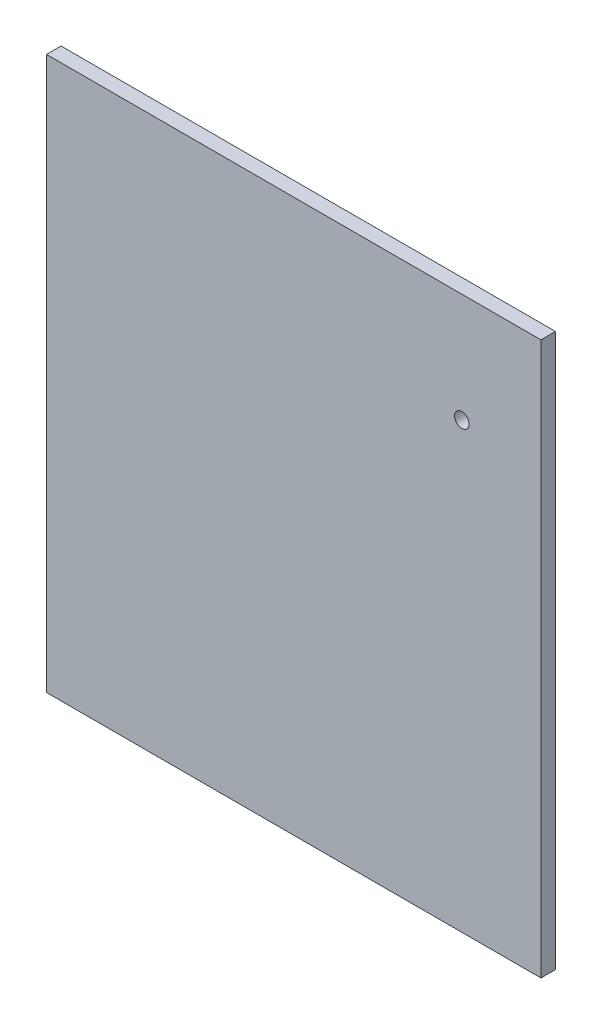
ISO-10303-21;
HEADER;
FILE_DESCRIPTION(('STEP AP214'),'2;1');
FILE_NAME('part.step','',(''),(''),'','','');
FILE_SCHEMA(('AUTOMOTIVE_DESIGN { 1 0 10303 214 1 1 1 1 }'));
ENDSEC;
DATA;
#1=APPLICATION_CONTEXT('core data for automotive mechanical design processes');
#2=APPLICATION_PROTOCOL_DEFINITION('international standard','automotive_design',2000,#1);
#3=PRODUCT_CONTEXT('',#1,'mechanical');
#4=PRODUCT('Part','Part','',(#3));
#5=PRODUCT_RELATED_PRODUCT_CATEGORY('part','',(#4));
#6=PRODUCT_DEFINITION_FORMATION('','',#4);
#7=PRODUCT_DEFINITION_CONTEXT('part definition',#1,'design');
#8=PRODUCT_DEFINITION('design','',#6,#7);
#9=PRODUCT_DEFINITION_SHAPE('','',#8);
#10=(LENGTH_UNIT() NAMED_UNIT(*) SI_UNIT(.MILLI.,.METRE.));
#11=(NAMED_UNIT(*) PLANE_ANGLE_UNIT() SI_UNIT($,.RADIAN.));
#12=(NAMED_UNIT(*) SI_UNIT($,.STERADIAN.) SOLID_ANGLE_UNIT());
#13=UNCERTAINTY_MEASURE_WITH_UNIT(LENGTH_MEASURE(1.E-05),#10,'distance_accuracy_value','');
#14=(GEOMETRIC_REPRESENTATION_CONTEXT(3) GLOBAL_UNCERTAINTY_ASSIGNED_CONTEXT((#13)) GLOBAL_UNIT_ASSIGNED_CONTEXT((#10,
#11,#12)) REPRESENTATION_CONTEXT('',''));
#15=CARTESIAN_POINT('',(0.,0.,0.));
#16=DIRECTION('',(0.,0.,1.));
#17=DIRECTION('',(1.,0.,0.));
#18=AXIS2_PLACEMENT_3D('',#15,#16,#17);
#19=CARTESIAN_POINT('',(0.,0.,12.7));
#20=DIRECTION('',(1.,0.,0.));
#21=DIRECTION('',(0.,1.,0.));
#22=AXIS2_PLACEMENT_3D('',#19,#20,#21);
#23=PLANE('',#22);
#24=DIRECTION('',(0.,-1.,0.));
#25=VECTOR('',#24,1.);
#26=CARTESIAN_POINT('',(0.,0.,0.));
#27=LINE('',#26,#25);
#28=CARTESIAN_POINT('',(0.,0.,0.));
#29=VERTEX_POINT('',#28);
#30=CARTESIAN_POINT('',(0.,-482.6,0.));
#31=VERTEX_POINT('',#30);
#32=EDGE_CURVE('E98',#29,#31,#27,.T.);
#33=ORIENTED_EDGE('',*,*,#32,.T.);
#34=DIRECTION('',(0.,0.,-1.));
#35=VECTOR('',#34,1.);
#36=CARTESIAN_POINT('',(0.,-482.6,12.7));
#37=LINE('',#36,#35);
#38=CARTESIAN_POINT('',(0.,-482.6,12.7));
#39=VERTEX_POINT('',#38);
#40=EDGE_CURVE('E11',#39,#31,#37,.T.);
#41=ORIENTED_EDGE('',*,*,#40,.F.);
#42=DIRECTION('',(0.,-1.,0.));
#43=VECTOR('',#42,1.);
#44=CARTESIAN_POINT('',(0.,0.,12.7));
#45=LINE('',#44,#43);
#46=CARTESIAN_POINT('',(0.,0.,12.7));
#47=VERTEX_POINT('',#46);
#48=EDGE_CURVE('E85',#47,#39,#45,.T.);
#49=ORIENTED_EDGE('',*,*,#48,.F.);
#50=DIRECTION('',(0.,0.,-1.));
#51=VECTOR('',#50,1.);
#52=CARTESIAN_POINT('',(0.,0.,12.7));
#53=LINE('',#52,#51);
#54=EDGE_CURVE('E94',#47,#29,#53,.T.);
#55=ORIENTED_EDGE('',*,*,#54,.T.);
#56=EDGE_LOOP('',(#33,#41,#49,#55));
#57=FACE_BOUND('',#56,.T.);
#58=ADVANCED_FACE('F33',(#57),#23,.F.);
#59=CARTESIAN_POINT('',(0.,-482.6,12.7));
#60=DIRECTION('',(0.,1.,0.));
#61=DIRECTION('',(-1.,0.,0.));
#62=AXIS2_PLACEMENT_3D('',#59,#60,#61);
#63=PLANE('',#62);
#64=DIRECTION('',(1.,0.,0.));
#65=VECTOR('',#64,1.);
#66=CARTESIAN_POINT('',(0.,-482.6,0.));
#67=LINE('',#66,#65);
#68=CARTESIAN_POINT('',(431.8,-482.6,0.));
#69=VERTEX_POINT('',#68);
#70=EDGE_CURVE('E89',#31,#69,#67,.T.);
#71=ORIENTED_EDGE('',*,*,#70,.T.);
#72=DIRECTION('',(0.,0.,-1.));
#73=VECTOR('',#72,1.);
#74=CARTESIAN_POINT('',(431.8,-482.6,12.7));
#75=LINE('',#74,#73);
#76=CARTESIAN_POINT('',(431.8,-482.6,12.7));
#77=VERTEX_POINT('',#76);
#78=EDGE_CURVE('E42',#77,#69,#75,.T.);
#79=ORIENTED_EDGE('',*,*,#78,.F.);
#80=DIRECTION('',(1.,0.,0.));
#81=VECTOR('',#80,1.);
#82=CARTESIAN_POINT('',(0.,-482.6,12.7));
#83=LINE('',#82,#81);
#84=EDGE_CURVE('E80',#39,#77,#83,.T.);
#85=ORIENTED_EDGE('',*,*,#84,.F.);
#86=ORIENTED_EDGE('',*,*,#40,.T.);
#87=EDGE_LOOP('',(#71,#79,#85,#86));
#88=FACE_BOUND('',#87,.T.);
#89=ADVANCED_FACE('F88',(#88),#63,.F.);
#90=CARTESIAN_POINT('',(431.8,0.,12.7));
#91=DIRECTION('',(-1.,0.,0.));
#92=DIRECTION('',(0.,0.,1.));
#93=AXIS2_PLACEMENT_3D('',#90,#91,#92);
#94=PLANE('',#93);
#95=DIRECTION('',(0.,1.,0.));
#96=VECTOR('',#95,1.);
#97=CARTESIAN_POINT('',(431.8,0.,0.));
#98=LINE('',#97,#96);
#99=CARTESIAN_POINT('',(431.8,0.,0.));
#100=VERTEX_POINT('',#99);
#101=EDGE_CURVE('E67',#69,#100,#98,.T.);
#102=ORIENTED_EDGE('',*,*,#101,.T.);
#103=DIRECTION('',(0.,0.,-1.));
#104=VECTOR('',#103,1.);
#105=CARTESIAN_POINT('',(431.8,0.,12.7));
#106=LINE('',#105,#104);
#107=CARTESIAN_POINT('',(431.8,0.,12.7));
#108=VERTEX_POINT('',#107);
#109=EDGE_CURVE('E90',#108,#100,#106,.T.);
#110=ORIENTED_EDGE('',*,*,#109,.F.);
#111=DIRECTION('',(0.,1.,0.));
#112=VECTOR('',#111,1.);
#113=CARTESIAN_POINT('',(431.8,0.,12.7));
#114=LINE('',#113,#112);
#115=EDGE_CURVE('E83',#77,#108,#114,.T.);
#116=ORIENTED_EDGE('',*,*,#115,.F.);
#117=ORIENTED_EDGE('',*,*,#78,.T.);
#118=EDGE_LOOP('',(#102,#110,#116,#117));
#119=FACE_BOUND('',#118,.T.);
#120=ADVANCED_FACE('F92',(#119),#94,.F.);
#121=CARTESIAN_POINT('',(0.,0.,12.7));
#122=DIRECTION('',(0.,-1.,0.));
#123=DIRECTION('',(0.,0.,-1.));
#124=AXIS2_PLACEMENT_3D('',#121,#122,#123);
#125=PLANE('',#124);
#126=DIRECTION('',(-1.,0.,0.));
#127=VECTOR('',#126,1.);
#128=CARTESIAN_POINT('',(0.,0.,0.));
#129=LINE('',#128,#127);
#130=EDGE_CURVE('E73',#100,#29,#129,.T.);
#131=ORIENTED_EDGE('',*,*,#130,.T.);
#132=ORIENTED_EDGE('',*,*,#54,.F.);
#133=DIRECTION('',(-1.,0.,0.));
#134=VECTOR('',#133,1.);
#135=CARTESIAN_POINT('',(0.,0.,12.7));
#136=LINE('',#135,#134);
#137=EDGE_CURVE('E50',#108,#47,#136,.T.);
#138=ORIENTED_EDGE('',*,*,#137,.F.);
#139=ORIENTED_EDGE('',*,*,#109,.T.);
#140=EDGE_LOOP('',(#131,#132,#138,#139));
#141=FACE_BOUND('',#140,.T.);
#142=ADVANCED_FACE('F105',(#141),#125,.F.);
#143=CARTESIAN_POINT('',(0.,0.,12.7));
#144=DIRECTION('',(0.,0.,1.));
#145=DIRECTION('',(1.,0.,0.));
#146=AXIS2_PLACEMENT_3D('',#143,#144,#145);
#147=PLANE('',#146);
#148=CARTESIAN_POINT('',(362.709181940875,-95.1208172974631,12.7));
#149=DIRECTION('',(0.,0.,1.));
#150=DIRECTION('',(1.,0.,0.));
#151=AXIS2_PLACEMENT_3D('',#148,#149,#150);
#152=CIRCLE('',#151,6.34999999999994);
#153=CARTESIAN_POINT('',(369.059181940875,-95.1208172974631,12.7));
#154=VERTEX_POINT('',#153);
#155=EDGE_CURVE('E111',#154,#154,#152,.T.);
#156=ORIENTED_EDGE('',*,*,#155,.F.);
#157=EDGE_LOOP('',(#156));
#158=FACE_BOUND('',#157,.T.);
#159=ORIENTED_EDGE('',*,*,#48,.T.);
#160=ORIENTED_EDGE('',*,*,#84,.T.);
#161=ORIENTED_EDGE('',*,*,#115,.T.);
#162=ORIENTED_EDGE('',*,*,#137,.T.);
#163=EDGE_LOOP('',(#159,#160,#161,#162));
#164=FACE_BOUND('',#163,.T.);
#165=ADVANCED_FACE('F81',(#158,#164),#147,.T.);
#166=CARTESIAN_POINT('',(0.,0.,0.));
#167=DIRECTION('',(0.,0.,1.));
#168=DIRECTION('',(1.,0.,0.));
#169=AXIS2_PLACEMENT_3D('',#166,#167,#168);
#170=PLANE('',#169);
#171=CARTESIAN_POINT('',(362.709181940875,-95.1208172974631,0.));
#172=DIRECTION('',(0.,0.,1.));
#173=DIRECTION('',(1.,0.,0.));
#174=AXIS2_PLACEMENT_3D('',#171,#172,#173);
#175=CIRCLE('',#174,6.34999999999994);
#176=CARTESIAN_POINT('',(369.059181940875,-95.1208172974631,0.));
#177=VERTEX_POINT('',#176);
#178=EDGE_CURVE('E36',#177,#177,#175,.T.);
#179=ORIENTED_EDGE('',*,*,#178,.T.);
#180=EDGE_LOOP('',(#179));
#181=FACE_BOUND('',#180,.T.);
#182=ORIENTED_EDGE('',*,*,#32,.F.);
#183=ORIENTED_EDGE('',*,*,#130,.F.);
#184=ORIENTED_EDGE('',*,*,#101,.F.);
#185=ORIENTED_EDGE('',*,*,#70,.F.);
#186=EDGE_LOOP('',(#182,#183,#184,#185));
#187=FACE_BOUND('',#186,.T.);
#188=ADVANCED_FACE('F108',(#181,#187),#170,.F.);
#189=CARTESIAN_POINT('',(362.709181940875,-95.1208172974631,-22.86));
#190=DIRECTION('',(0.,0.,1.));
#191=DIRECTION('',(1.,0.,0.));
#192=AXIS2_PLACEMENT_3D('',#189,#190,#191);
#193=CYLINDRICAL_SURFACE('',#192,6.34999999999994);
#194=CARTESIAN_POINT('',(369.059181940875,-95.1208172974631,12.7));
#195=CARTESIAN_POINT('',(369.059181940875,-95.1208172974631,12.5677083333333));
#196=CARTESIAN_POINT('',(369.059181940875,-95.1208172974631,12.4354166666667));
#197=CARTESIAN_POINT('',(369.059181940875,-95.1208172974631,12.1708333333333));
#198=CARTESIAN_POINT('',(369.059181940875,-95.1208172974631,12.0385416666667));
#199=CARTESIAN_POINT('',(369.059181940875,-95.1208172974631,11.7739583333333));
#200=CARTESIAN_POINT('',(369.059181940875,-95.1208172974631,11.6416666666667));
#201=CARTESIAN_POINT('',(369.059181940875,-95.1208172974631,11.3770833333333));
#202=CARTESIAN_POINT('',(369.059181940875,-95.1208172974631,11.2447916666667));
#203=CARTESIAN_POINT('',(369.059181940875,-95.1208172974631,10.9802083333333));
#204=CARTESIAN_POINT('',(369.059181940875,-95.1208172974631,10.8479166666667));
#205=CARTESIAN_POINT('',(369.059181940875,-95.1208172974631,10.5833333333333));
#206=CARTESIAN_POINT('',(369.059181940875,-95.1208172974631,10.4510416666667));
#207=CARTESIAN_POINT('',(369.059181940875,-95.1208172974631,10.1864583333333));
#208=CARTESIAN_POINT('',(369.059181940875,-95.1208172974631,10.0541666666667));
#209=CARTESIAN_POINT('',(369.059181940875,-95.1208172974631,9.78958333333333));
#210=CARTESIAN_POINT('',(369.059181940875,-95.1208172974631,9.65729166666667));
#211=CARTESIAN_POINT('',(369.059181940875,-95.1208172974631,9.39270833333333));
#212=CARTESIAN_POINT('',(369.059181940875,-95.1208172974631,9.26041666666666));
#213=CARTESIAN_POINT('',(369.059181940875,-95.1208172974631,8.99583333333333));
#214=CARTESIAN_POINT('',(369.059181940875,-95.1208172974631,8.86354166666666));
#215=CARTESIAN_POINT('',(369.059181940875,-95.1208172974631,8.59895833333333));
#216=CARTESIAN_POINT('',(369.059181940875,-95.1208172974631,8.46666666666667));
#217=CARTESIAN_POINT('',(369.059181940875,-95.1208172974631,8.20208333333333));
#218=CARTESIAN_POINT('',(369.059181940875,-95.1208172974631,8.06979166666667));
#219=CARTESIAN_POINT('',(369.059181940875,-95.1208172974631,7.80520833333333));
#220=CARTESIAN_POINT('',(369.059181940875,-95.1208172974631,7.67291666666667));
#221=CARTESIAN_POINT('',(369.059181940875,-95.1208172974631,7.40833333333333));
#222=CARTESIAN_POINT('',(369.059181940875,-95.1208172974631,7.27604166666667));
#223=CARTESIAN_POINT('',(369.059181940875,-95.1208172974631,7.01145833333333));
#224=CARTESIAN_POINT('',(369.059181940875,-95.1208172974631,6.87916666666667));
#225=CARTESIAN_POINT('',(369.059181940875,-95.1208172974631,6.61458333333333));
#226=CARTESIAN_POINT('',(369.059181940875,-95.1208172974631,6.48229166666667));
#227=CARTESIAN_POINT('',(369.059181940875,-95.1208172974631,6.21770833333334));
#228=CARTESIAN_POINT('',(369.059181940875,-95.1208172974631,6.08541666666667));
#229=CARTESIAN_POINT('',(369.059181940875,-95.1208172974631,5.82083333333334));
#230=CARTESIAN_POINT('',(369.059181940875,-95.1208172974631,5.68854166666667));
#231=CARTESIAN_POINT('',(369.059181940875,-95.1208172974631,5.42395833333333));
#232=CARTESIAN_POINT('',(369.059181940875,-95.1208172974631,5.29166666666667));
#233=CARTESIAN_POINT('',(369.059181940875,-95.1208172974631,5.02708333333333));
#234=CARTESIAN_POINT('',(369.059181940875,-95.1208172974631,4.89479166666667));
#235=CARTESIAN_POINT('',(369.059181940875,-95.1208172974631,4.63020833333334));
#236=CARTESIAN_POINT('',(369.059181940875,-95.1208172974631,4.49791666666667));
#237=CARTESIAN_POINT('',(369.059181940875,-95.1208172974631,4.23333333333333));
#238=CARTESIAN_POINT('',(369.059181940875,-95.1208172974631,4.10104166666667));
#239=CARTESIAN_POINT('',(369.059181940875,-95.1208172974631,3.83645833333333));
#240=CARTESIAN_POINT('',(369.059181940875,-95.1208172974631,3.70416666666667));
#241=CARTESIAN_POINT('',(369.059181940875,-95.1208172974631,3.43958333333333));
#242=CARTESIAN_POINT('',(369.059181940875,-95.1208172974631,3.30729166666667));
#243=CARTESIAN_POINT('',(369.059181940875,-95.1208172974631,3.04270833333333));
#244=CARTESIAN_POINT('',(369.059181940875,-95.1208172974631,2.91041666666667));
#245=CARTESIAN_POINT('',(369.059181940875,-95.1208172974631,2.64583333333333));
#246=CARTESIAN_POINT('',(369.059181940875,-95.1208172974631,2.51354166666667));
#247=CARTESIAN_POINT('',(369.059181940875,-95.1208172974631,2.24895833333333));
#248=CARTESIAN_POINT('',(369.059181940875,-95.1208172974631,2.11666666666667));
#249=CARTESIAN_POINT('',(369.059181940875,-95.1208172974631,1.85208333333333));
#250=CARTESIAN_POINT('',(369.059181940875,-95.1208172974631,1.71979166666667));
#251=CARTESIAN_POINT('',(369.059181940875,-95.1208172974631,1.45520833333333));
#252=CARTESIAN_POINT('',(369.059181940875,-95.1208172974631,1.32291666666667));
#253=CARTESIAN_POINT('',(369.059181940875,-95.1208172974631,1.05833333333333));
#254=CARTESIAN_POINT('',(369.059181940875,-95.1208172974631,0.926041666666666));
#255=CARTESIAN_POINT('',(369.059181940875,-95.1208172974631,0.661458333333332));
#256=CARTESIAN_POINT('',(369.059181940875,-95.1208172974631,0.529166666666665));
#257=CARTESIAN_POINT('',(369.059181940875,-95.1208172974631,0.264583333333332));
#258=CARTESIAN_POINT('',(369.059181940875,-95.1208172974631,0.132291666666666));
#259=CARTESIAN_POINT('',(369.059181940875,-95.1208172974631,0.));
#260=B_SPLINE_CURVE_WITH_KNOTS('',3,(#194,#195,#196,#197,#198,#199,#200,#201,#202,#203,#204,
#205,#206,#207,#208,#209,#210,#211,#212,#213,#214,#215,#216,#217,#218,#219,#220,#221,#222,#223,
#224,#225,#226,#227,#228,#229,#230,#231,#232,#233,#234,#235,#236,#237,#238,#239,#240,#241,#242,
#243,#244,#245,#246,#247,#248,#249,#250,#251,#252,#253,#254,#255,#256,#257,#258,#259),
.UNSPECIFIED.,.F.,.F.,(4,2,2,2,2,2,2,2,2,2,2,2,2,2,2,2,2,2,2,2,2,2,2,2,2,2,2,2,2,2,2,2,4),(0.,
0.396874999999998,0.793750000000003,1.190625,1.5875,1.984375,2.38125,2.778125,3.175,3.571875,
3.96875,4.365625,4.7625,5.159375,5.55625,5.953125,6.35,6.746875,7.14375,7.540625,7.9375,
8.334375,8.73125,9.128125,9.525,9.921875,10.31875,10.715625,11.1125,11.509375,11.90625,
12.303125,12.7),.UNSPECIFIED.);
#261=EDGE_CURVE('BSEAM119',#154,#177,#260,.T.);
#262=ORIENTED_EDGE('',*,*,#155,.T.);
#263=ORIENTED_EDGE('',*,*,#178,.F.);
#264=ORIENTED_EDGE('',*,*,#261,.T.);
#265=ORIENTED_EDGE('',*,*,#261,.F.);
#266=EDGE_LOOP('',(#262,#264,#263,#265));
#267=FACE_BOUND('',#266,.T.);
#268=ADVANCED_FACE('F119',(#267),#193,.F.);
#269=CLOSED_SHELL('',(#58,#89,#120,#142,#165,#188,#268));
#270=MANIFOLD_SOLID_BREP('B2',#269);
#271=ADVANCED_BREP_SHAPE_REPRESENTATION('',(#18,#270),#14);
#272=SHAPE_DEFINITION_REPRESENTATION(#9,#271);
ENDSEC;
END-ISO-10303-21;
